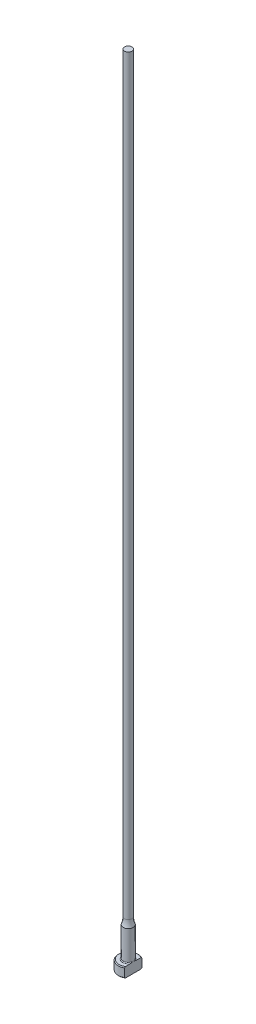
ISO-10303-21;
HEADER;
FILE_DESCRIPTION(('STEP AP214'),'2;1');
FILE_NAME('part.step','',(''),(''),'','','');
FILE_SCHEMA(('AUTOMOTIVE_DESIGN { 1 0 10303 214 1 1 1 1 }'));
ENDSEC;
DATA;
#1=APPLICATION_CONTEXT('core data for automotive mechanical design processes');
#2=APPLICATION_PROTOCOL_DEFINITION('international standard','automotive_design',2000,#1);
#3=PRODUCT_CONTEXT('',#1,'mechanical');
#4=PRODUCT('Part','Part','',(#3));
#5=PRODUCT_RELATED_PRODUCT_CATEGORY('part','',(#4));
#6=PRODUCT_DEFINITION_FORMATION('','',#4);
#7=PRODUCT_DEFINITION_CONTEXT('part definition',#1,'design');
#8=PRODUCT_DEFINITION('design','',#6,#7);
#9=PRODUCT_DEFINITION_SHAPE('','',#8);
#10=(LENGTH_UNIT() NAMED_UNIT(*) SI_UNIT(.MILLI.,.METRE.));
#11=(NAMED_UNIT(*) PLANE_ANGLE_UNIT() SI_UNIT($,.RADIAN.));
#12=(NAMED_UNIT(*) SI_UNIT($,.STERADIAN.) SOLID_ANGLE_UNIT());
#13=UNCERTAINTY_MEASURE_WITH_UNIT(LENGTH_MEASURE(1.E-05),#10,'distance_accuracy_value','');
#14=(GEOMETRIC_REPRESENTATION_CONTEXT(3) GLOBAL_UNCERTAINTY_ASSIGNED_CONTEXT((#13)) GLOBAL_UNIT_ASSIGNED_CONTEXT((#10,
#11,#12)) REPRESENTATION_CONTEXT('',''));
#15=CARTESIAN_POINT('',(0.,0.,0.));
#16=DIRECTION('',(0.,0.,1.));
#17=DIRECTION('',(1.,0.,0.));
#18=AXIS2_PLACEMENT_3D('',#15,#16,#17);
#19=CARTESIAN_POINT('',(-3.17499999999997,3.175,0.));
#20=DIRECTION('',(0.,1.,0.));
#21=DIRECTION('',(0.,0.,1.));
#22=AXIS2_PLACEMENT_3D('',#19,#20,#21);
#23=PLANE('',#22);
#24=CARTESIAN_POINT('',(0.,3.175,0.));
#25=DIRECTION('',(0.,1.,0.));
#26=DIRECTION('',(0.,0.,1.));
#27=AXIS2_PLACEMENT_3D('',#24,#25,#26);
#28=CIRCLE('',#27,2.92099999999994);
#29=CARTESIAN_POINT('',(1.58749999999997,3.175,-2.45195529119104));
#30=VERTEX_POINT('',#29);
#31=CARTESIAN_POINT('',(1.58749999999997,3.175,2.45195529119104));
#32=VERTEX_POINT('',#31);
#33=EDGE_CURVE('E105',#30,#32,#28,.T.);
#34=ORIENTED_EDGE('',*,*,#33,.T.);
#35=DIRECTION('',(0.,0.,1.));
#36=VECTOR('',#35,1.);
#37=CARTESIAN_POINT('',(1.58749999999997,3.17499999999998,2.74963065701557));
#38=LINE('',#37,#36);
#39=CARTESIAN_POINT('',(1.58749999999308,3.175,0.933255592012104));
#40=VERTEX_POINT('',#39);
#41=EDGE_CURVE('E126',#40,#32,#38,.T.);
#42=ORIENTED_EDGE('',*,*,#41,.F.);
#43=CARTESIAN_POINT('',(0.,3.175,0.));
#44=DIRECTION('',(0.,1.,0.));
#45=DIRECTION('',(0.,0.,1.));
#46=AXIS2_PLACEMENT_3D('',#43,#44,#45);
#47=CIRCLE('',#46,1.84149999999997);
#48=CARTESIAN_POINT('',(1.58749999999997,3.17500000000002,-0.933255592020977));
#49=VERTEX_POINT('',#48);
#50=EDGE_CURVE('E11',#40,#49,#47,.F.);
#51=ORIENTED_EDGE('',*,*,#50,.T.);
#52=EDGE_CURVE('E52',#30,#49,#38,.T.);
#53=ORIENTED_EDGE('',*,*,#52,.F.);
#54=EDGE_LOOP('',(#34,#42,#51,#53));
#55=FACE_BOUND('',#54,.T.);
#56=ADVANCED_FACE('F32',(#55),#23,.T.);
#57=CARTESIAN_POINT('',(0.,259.958771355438,0.));
#58=DIRECTION('',(0.,1.,0.));
#59=DIRECTION('',(0.,0.,1.));
#60=AXIS2_PLACEMENT_3D('',#57,#58,#59);
#61=CYLINDRICAL_SURFACE('',#60,3.17499999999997);
#62=CARTESIAN_POINT('',(0.,2.92100000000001,0.));
#63=DIRECTION('',(0.,1.,0.));
#64=DIRECTION('',(0.,0.,1.));
#65=AXIS2_PLACEMENT_3D('',#62,#63,#64);
#66=CIRCLE('',#65,3.17499999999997);
#67=CARTESIAN_POINT('',(1.58749999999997,2.92100000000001,2.74963065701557));
#68=VERTEX_POINT('',#67);
#69=CARTESIAN_POINT('',(1.58749999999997,2.92100000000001,-2.74963065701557));
#70=VERTEX_POINT('',#69);
#71=EDGE_CURVE('E98',#68,#70,#66,.F.);
#72=ORIENTED_EDGE('',*,*,#71,.T.);
#73=DIRECTION('',(0.,-1.,0.));
#74=VECTOR('',#73,1.);
#75=CARTESIAN_POINT('',(1.58749999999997,254.001,-2.74963065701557));
#76=LINE('',#75,#74);
#77=CARTESIAN_POINT('',(1.58749999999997,0.253999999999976,-2.74963065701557));
#78=VERTEX_POINT('',#77);
#79=EDGE_CURVE('E141',#70,#78,#76,.T.);
#80=ORIENTED_EDGE('',*,*,#79,.T.);
#81=CARTESIAN_POINT('',(0.,0.253999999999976,0.));
#82=DIRECTION('',(0.,-1.,0.));
#83=DIRECTION('',(0.,0.,-1.));
#84=AXIS2_PLACEMENT_3D('',#81,#82,#83);
#85=CIRCLE('',#84,3.17499999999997);
#86=CARTESIAN_POINT('',(1.58749999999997,0.253999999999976,2.74963065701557));
#87=VERTEX_POINT('',#86);
#88=EDGE_CURVE('E95',#78,#87,#85,.F.);
#89=ORIENTED_EDGE('',*,*,#88,.T.);
#90=DIRECTION('',(0.,-1.,0.));
#91=VECTOR('',#90,1.);
#92=CARTESIAN_POINT('',(1.58749999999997,254.001,2.74963065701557));
#93=LINE('',#92,#91);
#94=EDGE_CURVE('E88',#68,#87,#93,.T.);
#95=ORIENTED_EDGE('',*,*,#94,.F.);
#96=EDGE_LOOP('',(#72,#80,#89,#95));
#97=FACE_BOUND('',#96,.T.);
#98=ADVANCED_FACE('F191',(#97),#61,.T.);
#99=CARTESIAN_POINT('',(0.,0.,0.));
#100=DIRECTION('',(0.,-1.,0.));
#101=DIRECTION('',(0.,0.,-1.));
#102=AXIS2_PLACEMENT_3D('',#99,#100,#101);
#103=PLANE('',#102);
#104=CARTESIAN_POINT('',(0.,0.,0.));
#105=DIRECTION('',(0.,-1.,0.));
#106=DIRECTION('',(0.,0.,-1.));
#107=AXIS2_PLACEMENT_3D('',#104,#105,#106);
#108=CIRCLE('',#107,2.92100000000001);
#109=CARTESIAN_POINT('',(1.58749999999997,0.,2.45195529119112));
#110=VERTEX_POINT('',#109);
#111=CARTESIAN_POINT('',(1.58749999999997,0.,-2.45195529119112));
#112=VERTEX_POINT('',#111);
#113=EDGE_CURVE('E93',#110,#112,#108,.T.);
#114=ORIENTED_EDGE('',*,*,#113,.T.);
#115=DIRECTION('',(0.,0.,1.));
#116=VECTOR('',#115,1.);
#117=CARTESIAN_POINT('',(1.58749999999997,0.,2.74963065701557));
#118=LINE('',#117,#116);
#119=EDGE_CURVE('E78',#112,#110,#118,.T.);
#120=ORIENTED_EDGE('',*,*,#119,.T.);
#121=EDGE_LOOP('',(#114,#120));
#122=FACE_BOUND('',#121,.T.);
#123=ADVANCED_FACE('F97',(#122),#103,.T.);
#124=CARTESIAN_POINT('',(0.,3.17499999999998,0.));
#125=DIRECTION('',(0.,-1.,0.));
#126=DIRECTION('',(0.,0.,-1.));
#127=AXIS2_PLACEMENT_3D('',#124,#125,#126);
#128=CONICAL_SURFACE('',#127,2.92099999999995,0.785398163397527);
#129=ORIENTED_EDGE('',*,*,#71,.F.);
#130=CARTESIAN_POINT('',(1.58749999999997,-0.16162066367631,-6.0529050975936));
#131=CARTESIAN_POINT('',(1.58749999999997,-0.0288893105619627,-5.91567682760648));
#132=CARTESIAN_POINT('',(1.58749999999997,0.103699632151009,-5.7783103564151));
#133=CARTESIAN_POINT('',(1.58749999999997,0.368508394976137,-5.50321874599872));
#134=CARTESIAN_POINT('',(1.58749999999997,0.500728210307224,-5.36549360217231));
#135=CARTESIAN_POINT('',(1.58749999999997,0.764778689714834,-5.08953516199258));
#136=CARTESIAN_POINT('',(1.58749999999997,0.896609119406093,-4.9513016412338));
#137=CARTESIAN_POINT('',(1.58749999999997,1.15968706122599,-4.67428233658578));
#138=CARTESIAN_POINT('',(1.58749999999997,1.29093457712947,-4.53549655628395));
#139=CARTESIAN_POINT('',(1.58749999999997,1.55007705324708,-4.25997724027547));
#140=CARTESIAN_POINT('',(1.58749999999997,1.67798684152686,-4.12325766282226));
#141=CARTESIAN_POINT('',(1.58749999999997,1.9328486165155,-3.84892898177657));
#142=CARTESIAN_POINT('',(1.58749999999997,2.05980060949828,-3.71131988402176));
#143=CARTESIAN_POINT('',(1.58749999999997,2.31237508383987,-3.43493978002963));
#144=CARTESIAN_POINT('',(1.58749999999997,2.43799784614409,-3.29616903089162));
#145=CARTESIAN_POINT('',(1.58749999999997,2.68741369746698,-3.01699558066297));
#146=CARTESIAN_POINT('',(1.58749999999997,2.81120686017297,-2.8765929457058));
#147=CARTESIAN_POINT('',(1.58749999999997,3.00875865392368,-2.64816703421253));
#148=CARTESIAN_POINT('',(1.58749999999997,3.08336151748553,-2.56087478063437));
#149=CARTESIAN_POINT('',(1.58749999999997,3.2312387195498,-2.38515423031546));
#150=CARTESIAN_POINT('',(1.58749999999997,3.30451292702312,-2.29672582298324));
#151=CARTESIAN_POINT('',(1.58749999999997,3.45004422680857,-2.1174740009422));
#152=CARTESIAN_POINT('',(1.58749999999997,3.5222823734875,-2.02663514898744));
#153=CARTESIAN_POINT('',(1.58749999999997,3.66423097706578,-1.8430252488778));
#154=CARTESIAN_POINT('',(1.58749999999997,3.73394203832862,-1.75025467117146));
#155=CARTESIAN_POINT('',(1.58749999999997,3.87080633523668,-1.5606747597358));
#156=CARTESIAN_POINT('',(1.58749999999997,3.93790459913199,-1.46382547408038));
#157=CARTESIAN_POINT('',(1.58749999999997,4.06669147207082,-1.26632594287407));
#158=CARTESIAN_POINT('',(1.58749999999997,4.1283726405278,-1.16567073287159));
#159=CARTESIAN_POINT('',(1.58749999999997,4.21402252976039,-1.01165766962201));
#160=CARTESIAN_POINT('',(1.58749999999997,4.24127929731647,-0.960142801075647));
#161=CARTESIAN_POINT('',(1.58749999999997,4.2930979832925,-0.855780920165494));
#162=CARTESIAN_POINT('',(1.58749999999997,4.31765941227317,-0.802933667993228));
#163=CARTESIAN_POINT('',(1.58749999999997,4.38614656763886,-0.642461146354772));
#164=CARTESIAN_POINT('',(1.58749999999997,4.42510149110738,-0.532518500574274));
#165=CARTESIAN_POINT('',(1.58749999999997,4.46726244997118,-0.367680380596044));
#166=CARTESIAN_POINT('',(1.58749999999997,4.47844427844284,-0.314802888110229));
#167=CARTESIAN_POINT('',(1.58749999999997,4.49576654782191,-0.208209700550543));
#168=CARTESIAN_POINT('',(1.58749999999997,4.50190743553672,-0.154494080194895));
#169=CARTESIAN_POINT('',(1.58749999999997,4.50871296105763,-0.0468792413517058));
#170=CARTESIAN_POINT('',(1.58749999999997,4.5093945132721,0.00701889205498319));
#171=CARTESIAN_POINT('',(1.58749999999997,4.50527679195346,0.114606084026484));
#172=CARTESIAN_POINT('',(1.58749999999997,4.50047706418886,0.168295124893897));
#173=CARTESIAN_POINT('',(1.58749999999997,4.48579689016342,0.27448544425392));
#174=CARTESIAN_POINT('',(1.58749999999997,4.47596081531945,0.32699298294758));
#175=CARTESIAN_POINT('',(1.58749999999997,4.45181809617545,0.430974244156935));
#176=CARTESIAN_POINT('',(1.58749999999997,4.4375096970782,0.482447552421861));
#177=CARTESIAN_POINT('',(1.58749999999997,4.40502489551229,0.584460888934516));
#178=CARTESIAN_POINT('',(1.58749999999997,4.386827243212,0.634994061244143));
#179=CARTESIAN_POINT('',(1.58749999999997,4.34729308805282,0.734789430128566));
#180=CARTESIAN_POINT('',(1.58749999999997,4.3259572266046,0.784051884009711));
#181=CARTESIAN_POINT('',(1.58749999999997,4.25791922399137,0.930549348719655));
#182=CARTESIAN_POINT('',(1.58749999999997,4.20736047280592,1.0259880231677));
#183=CARTESIAN_POINT('',(1.58749999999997,4.0995545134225,1.21304313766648));
#184=CARTESIAN_POINT('',(1.58749999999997,4.04229912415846,1.30465471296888));
#185=CARTESIAN_POINT('',(1.58749999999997,3.92308746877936,1.48526211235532));
#186=CARTESIAN_POINT('',(1.58749999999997,3.86111349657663,1.57424615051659));
#187=CARTESIAN_POINT('',(1.58749999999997,3.73408621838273,1.74990003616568));
#188=CARTESIAN_POINT('',(1.58749999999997,3.66903444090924,1.83657099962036));
#189=CARTESIAN_POINT('',(1.58749999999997,3.53583371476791,2.00931764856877));
#190=CARTESIAN_POINT('',(1.58749999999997,3.46765527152,2.09537048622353));
#191=CARTESIAN_POINT('',(1.58749999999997,3.32960643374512,2.26611736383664));
#192=CARTESIAN_POINT('',(1.58749999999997,3.25973586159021,2.35081125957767));
#193=CARTESIAN_POINT('',(1.58749999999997,3.04858139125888,2.60290121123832));
#194=CARTESIAN_POINT('',(1.58749999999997,2.90542388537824,2.76872537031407));
#195=CARTESIAN_POINT('',(1.58749999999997,2.64069522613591,3.06970913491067));
#196=CARTESIAN_POINT('',(1.58749999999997,2.51959458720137,3.20528660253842));
#197=CARTESIAN_POINT('',(1.58749999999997,2.27590400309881,3.47510321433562));
#198=CARTESIAN_POINT('',(1.58749999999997,2.15331401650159,3.60934232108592));
#199=CARTESIAN_POINT('',(1.58749999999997,1.90694239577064,3.87695374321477));
#200=CARTESIAN_POINT('',(1.58749999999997,1.78315974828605,4.0103251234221));
#201=CARTESIAN_POINT('',(1.58749999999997,1.53478104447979,4.27630880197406));
#202=CARTESIAN_POINT('',(1.58749999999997,1.41018498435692,4.40892109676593));
#203=CARTESIAN_POINT('',(1.58749999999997,1.0457468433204,4.79499418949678));
#204=CARTESIAN_POINT('',(1.58749999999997,0.80507680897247,5.04767313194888));
#205=CARTESIAN_POINT('',(1.58749999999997,0.443121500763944,5.42550911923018));
#206=CARTESIAN_POINT('',(1.58749999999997,0.322378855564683,5.55118772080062));
#207=CARTESIAN_POINT('',(1.58749999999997,0.0805914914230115,5.80225207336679));
#208=CARTESIAN_POINT('',(1.58749999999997,-0.040453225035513,5.92763782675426));
#209=CARTESIAN_POINT('',(1.58749999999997,-0.161620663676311,6.0529050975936));
#210=B_SPLINE_CURVE_WITH_KNOTS('',3,(#130,#131,#132,#133,#134,#135,#136,#137,#138,#139,#140,
#141,#142,#143,#144,#145,#146,#147,#148,#149,#150,#151,#152,#153,#154,#155,#156,#157,#158,#159,
#160,#161,#162,#163,#164,#165,#166,#167,#168,#169,#170,#171,#172,#173,#174,#175,#176,#177,#178,
#179,#180,#181,#182,#183,#184,#185,#186,#187,#188,#189,#190,#191,#192,#193,#194,#195,#196,#197,
#198,#199,#200,#201,#202,#203,#204,#205,#206,#207,#208,#209),.UNSPECIFIED.,.F.,.F.,(4,2,2,2,2,2,
2,2,2,2,2,2,2,2,2,2,2,2,2,2,2,2,2,2,2,2,2,2,2,2,2,2,2,2,2,2,2,2,2,4),(0.,0.572750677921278,
1.14550874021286,1.71856057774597,2.29160869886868,2.85328006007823,3.4149477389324,
3.97649423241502,4.53801804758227,4.88249307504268,5.22700189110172,5.5751532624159,
5.92322081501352,6.27657800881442,6.63041319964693,6.80518126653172,6.9799810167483,
7.3282426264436,7.49018491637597,7.65211285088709,7.81353889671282,7.97497832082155,
8.13501929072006,8.29512313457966,8.45612518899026,8.61709438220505,8.94062993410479,
9.2645649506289,9.58978187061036,9.91483894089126,10.2441741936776,10.5735441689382,
11.2306812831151,11.7760337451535,12.3214014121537,12.8672825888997,13.4131663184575,
14.4600164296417,14.9828595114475,15.5056983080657),.UNSPECIFIED.);
#211=EDGE_CURVE('E118',#32,#68,#210,.T.);
#212=ORIENTED_EDGE('',*,*,#211,.F.);
#213=ORIENTED_EDGE('',*,*,#33,.F.);
#214=EDGE_CURVE('E117',#70,#30,#210,.T.);
#215=ORIENTED_EDGE('',*,*,#214,.F.);
#216=EDGE_LOOP('',(#129,#212,#213,#215));
#217=FACE_BOUND('',#216,.T.);
#218=ADVANCED_FACE('F162',(#217),#128,.T.);
#219=CARTESIAN_POINT('',(0.,0.253999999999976,0.));
#220=DIRECTION('',(0.,1.,0.));
#221=DIRECTION('',(0.,0.,1.));
#222=AXIS2_PLACEMENT_3D('',#219,#220,#221);
#223=CONICAL_SURFACE('',#222,3.17499999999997,0.785398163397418);
#224=ORIENTED_EDGE('',*,*,#88,.F.);
#225=CARTESIAN_POINT('',(1.58749999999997,3.33662066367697,6.0529050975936));
#226=CARTESIAN_POINT('',(1.58749999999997,3.20388931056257,5.91567682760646));
#227=CARTESIAN_POINT('',(1.58749999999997,3.07130036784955,5.77831035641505));
#228=CARTESIAN_POINT('',(1.58749999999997,2.80649160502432,5.50321874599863));
#229=CARTESIAN_POINT('',(1.58749999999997,2.67427178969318,5.3654936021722));
#230=CARTESIAN_POINT('',(1.58749999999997,2.41022131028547,5.08953516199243));
#231=CARTESIAN_POINT('',(1.58749999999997,2.27839088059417,4.95130164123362));
#232=CARTESIAN_POINT('',(1.58749999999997,2.01531293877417,4.67428233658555));
#233=CARTESIAN_POINT('',(1.58749999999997,1.88406542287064,4.5354965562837));
#234=CARTESIAN_POINT('',(1.58749999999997,1.62492294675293,4.25997724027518));
#235=CARTESIAN_POINT('',(1.58749999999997,1.49701315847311,4.12325766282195));
#236=CARTESIAN_POINT('',(1.58749999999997,1.24215138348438,3.84892898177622));
#237=CARTESIAN_POINT('',(1.58749999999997,1.11519939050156,3.71131988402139));
#238=CARTESIAN_POINT('',(1.58749999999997,0.862624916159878,3.43493978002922));
#239=CARTESIAN_POINT('',(1.58749999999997,0.737002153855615,3.29616903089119));
#240=CARTESIAN_POINT('',(1.58749999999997,0.487586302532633,3.01699558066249));
#241=CARTESIAN_POINT('',(1.58749999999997,0.363793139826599,2.8765929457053));
#242=CARTESIAN_POINT('',(1.58749999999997,0.166241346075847,2.64816703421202));
#243=CARTESIAN_POINT('',(1.58749999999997,0.0916384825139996,2.56087478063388));
#244=CARTESIAN_POINT('',(1.58749999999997,-0.0562387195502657,2.385154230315));
#245=CARTESIAN_POINT('',(1.58749999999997,-0.129512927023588,2.29672582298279));
#246=CARTESIAN_POINT('',(1.58749999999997,-0.27504422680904,2.11747400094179));
#247=CARTESIAN_POINT('',(1.58749999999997,-0.347282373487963,2.02663514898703));
#248=CARTESIAN_POINT('',(1.58749999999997,-0.489230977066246,1.84302524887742));
#249=CARTESIAN_POINT('',(1.58749999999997,-0.558942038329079,1.7502546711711));
#250=CARTESIAN_POINT('',(1.58749999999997,-0.695806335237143,1.56067475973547));
#251=CARTESIAN_POINT('',(1.58749999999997,-0.762904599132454,1.46382547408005));
#252=CARTESIAN_POINT('',(1.58749999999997,-0.891691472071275,1.26632594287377));
#253=CARTESIAN_POINT('',(1.58749999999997,-0.953372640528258,1.16567073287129));
#254=CARTESIAN_POINT('',(1.58749999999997,-1.03902252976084,1.01165766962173));
#255=CARTESIAN_POINT('',(1.58749999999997,-1.06627929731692,0.960142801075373));
#256=CARTESIAN_POINT('',(1.58749999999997,-1.11809798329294,0.85578092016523));
#257=CARTESIAN_POINT('',(1.58749999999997,-1.14265941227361,0.802933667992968));
#258=CARTESIAN_POINT('',(1.58749999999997,-1.21114656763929,0.642461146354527));
#259=CARTESIAN_POINT('',(1.58749999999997,-1.2501014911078,0.532518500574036));
#260=CARTESIAN_POINT('',(1.58749999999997,-1.29226244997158,0.367680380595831));
#261=CARTESIAN_POINT('',(1.58749999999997,-1.30344427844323,0.314802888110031));
#262=CARTESIAN_POINT('',(1.58749999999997,-1.32076654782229,0.208209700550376));
#263=CARTESIAN_POINT('',(1.58749999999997,-1.3269074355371,0.154494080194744));
#264=CARTESIAN_POINT('',(1.58749999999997,-1.333712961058,0.0468792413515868));
#265=CARTESIAN_POINT('',(1.58749999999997,-1.33439451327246,-0.00701889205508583));
#266=CARTESIAN_POINT('',(1.58749999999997,-1.33027679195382,-0.114606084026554));
#267=CARTESIAN_POINT('',(1.58749999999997,-1.32547706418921,-0.168295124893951));
#268=CARTESIAN_POINT('',(1.58749999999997,-1.31079689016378,-0.274485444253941));
#269=CARTESIAN_POINT('',(1.58749999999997,-1.3009608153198,-0.326992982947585));
#270=CARTESIAN_POINT('',(1.58749999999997,-1.27681809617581,-0.430974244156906));
#271=CARTESIAN_POINT('',(1.58749999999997,-1.26250969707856,-0.482447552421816));
#272=CARTESIAN_POINT('',(1.58749999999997,-1.23002489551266,-0.584460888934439));
#273=CARTESIAN_POINT('',(1.58749999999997,-1.21182724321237,-0.634994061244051));
#274=CARTESIAN_POINT('',(1.58749999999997,-1.1722930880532,-0.734789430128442));
#275=CARTESIAN_POINT('',(1.58749999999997,-1.15095722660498,-0.784051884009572));
#276=CARTESIAN_POINT('',(1.58749999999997,-1.08291922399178,-0.93054934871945));
#277=CARTESIAN_POINT('',(1.58749999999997,-1.03236047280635,-1.02598802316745));
#278=CARTESIAN_POINT('',(1.58749999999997,-0.924554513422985,-1.21304313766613));
#279=CARTESIAN_POINT('',(1.58749999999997,-0.86729912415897,-1.30465471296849));
#280=CARTESIAN_POINT('',(1.58749999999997,-0.748087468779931,-1.48526211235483));
#281=CARTESIAN_POINT('',(1.58749999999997,-0.686113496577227,-1.57424615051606));
#282=CARTESIAN_POINT('',(1.58749999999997,-0.55908621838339,-1.74990003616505));
#283=CARTESIAN_POINT('',(1.58749999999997,-0.494034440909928,-1.83657099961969));
#284=CARTESIAN_POINT('',(1.58749999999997,-0.360833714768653,-2.00931764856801));
#285=CARTESIAN_POINT('',(1.58749999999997,-0.292655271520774,-2.09537048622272));
#286=CARTESIAN_POINT('',(1.58749999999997,-0.154606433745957,-2.26611736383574));
#287=CARTESIAN_POINT('',(1.58749999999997,-0.0847358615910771,-2.35081125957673));
#288=CARTESIAN_POINT('',(1.58749999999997,0.126418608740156,-2.60290121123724));
#289=CARTESIAN_POINT('',(1.58749999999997,0.269576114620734,-2.76872537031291));
#290=CARTESIAN_POINT('',(1.58749999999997,0.534304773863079,-3.06970913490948));
#291=CARTESIAN_POINT('',(1.58749999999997,0.655405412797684,-3.20528660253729));
#292=CARTESIAN_POINT('',(1.58749999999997,0.899095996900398,-3.47510321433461));
#293=CARTESIAN_POINT('',(1.58749999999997,1.02168598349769,-3.60934232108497));
#294=CARTESIAN_POINT('',(1.58749999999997,1.26805760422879,-3.87695374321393));
#295=CARTESIAN_POINT('',(1.58749999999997,1.39184025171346,-4.01032512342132));
#296=CARTESIAN_POINT('',(1.58749999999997,1.64021895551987,-4.2763088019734));
#297=CARTESIAN_POINT('',(1.58749999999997,1.76481501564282,-4.40892109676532));
#298=CARTESIAN_POINT('',(1.58749999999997,2.12925315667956,-4.79499418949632));
#299=CARTESIAN_POINT('',(1.58749999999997,2.36992319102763,-5.04767313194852));
#300=CARTESIAN_POINT('',(1.58749999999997,2.73187849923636,-5.42550911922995));
#301=CARTESIAN_POINT('',(1.58749999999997,2.85262114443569,-5.55118772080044));
#302=CARTESIAN_POINT('',(1.58749999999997,3.09440850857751,-5.8022520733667));
#303=CARTESIAN_POINT('',(1.58749999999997,3.2154532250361,-5.92763782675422));
#304=CARTESIAN_POINT('',(1.58749999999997,3.33662066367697,-6.0529050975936));
#305=B_SPLINE_CURVE_WITH_KNOTS('',3,(#225,#226,#227,#228,#229,#230,#231,#232,#233,#234,#235,
#236,#237,#238,#239,#240,#241,#242,#243,#244,#245,#246,#247,#248,#249,#250,#251,#252,#253,#254,
#255,#256,#257,#258,#259,#260,#261,#262,#263,#264,#265,#266,#267,#268,#269,#270,#271,#272,#273,
#274,#275,#276,#277,#278,#279,#280,#281,#282,#283,#284,#285,#286,#287,#288,#289,#290,#291,#292,
#293,#294,#295,#296,#297,#298,#299,#300,#301,#302,#303,#304),.UNSPECIFIED.,.F.,.F.,(4,2,2,2,2,2,
2,2,2,2,2,2,2,2,2,2,2,2,2,2,2,2,2,2,2,2,2,2,2,2,2,2,2,2,2,2,2,2,2,4),(0.,0.57275067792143,
1.14550874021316,1.71856057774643,2.29160869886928,2.85328006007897,3.41494773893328,
3.97649423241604,4.53801804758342,4.88249307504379,5.2270018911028,5.57515326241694,
5.92322081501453,6.27657800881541,6.63041319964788,6.80518126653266,6.97998101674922,
7.32824262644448,7.49018491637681,7.65211285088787,7.81353889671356,7.97497832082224,
8.1350192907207,8.29512313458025,8.45612518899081,8.61709438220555,8.94062993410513,
9.26456495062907,9.58978187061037,9.91483894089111,10.2441741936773,10.5735441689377,
11.2306812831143,11.776033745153,12.3214014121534,12.8672825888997,13.4131663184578,
14.4600164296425,14.9828595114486,15.505698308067),.UNSPECIFIED.);
#306=EDGE_CURVE('E81',#112,#78,#305,.T.);
#307=ORIENTED_EDGE('',*,*,#306,.F.);
#308=ORIENTED_EDGE('',*,*,#113,.F.);
#309=EDGE_CURVE('E84',#87,#110,#305,.T.);
#310=ORIENTED_EDGE('',*,*,#309,.F.);
#311=EDGE_LOOP('',(#224,#307,#308,#310));
#312=FACE_BOUND('',#311,.T.);
#313=ADVANCED_FACE('F92',(#312),#223,.T.);
#314=CARTESIAN_POINT('',(0.,3.42900000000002,0.));
#315=DIRECTION('',(0.,1.,0.));
#316=DIRECTION('',(0.,0.,1.));
#317=AXIS2_PLACEMENT_3D('',#314,#315,#316);
#318=TOROIDAL_SURFACE('',#317,1.84149999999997,0.254);
#319=CARTESIAN_POINT('',(1.58749999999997,3.42900000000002,0.));
#320=CARTESIAN_POINT('',(1.58749999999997,3.42899942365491,-1.9220514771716E-10));
#321=CARTESIAN_POINT('',(1.58749999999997,3.42899884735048,-1.2261161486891E-07));
#322=CARTESIAN_POINT('',(1.58749999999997,3.42899773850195,-5.09676365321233E-07));
#323=CARTESIAN_POINT('',(1.58749999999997,3.42899720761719,-7.78176328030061E-07));
#324=CARTESIAN_POINT('',(1.58749999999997,3.42899614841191,-1.42307272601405E-06));
#325=CARTESIAN_POINT('',(1.58749999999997,3.42899562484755,-1.80713867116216E-06));
#326=CARTESIAN_POINT('',(1.58749999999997,3.42899463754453,-2.63494846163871E-06));
#327=CARTESIAN_POINT('',(1.58749999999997,3.42899417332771,-3.07814756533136E-06));
#328=CARTESIAN_POINT('',(1.58749999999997,3.42899261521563,-4.66897357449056E-06));
#329=CARTESIAN_POINT('',(1.58749999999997,3.42899159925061,-5.89404908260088E-06));
#330=CARTESIAN_POINT('',(1.58749999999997,3.42898979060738,-8.42427511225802E-06));
#331=CARTESIAN_POINT('',(1.58749999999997,3.42898899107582,-9.7248057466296E-06));
#332=CARTESIAN_POINT('',(1.58749999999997,3.42898598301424,-1.48060601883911E-05));
#333=CARTESIAN_POINT('',(1.58749999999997,3.42898393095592,-1.86838281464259E-05));
#334=CARTESIAN_POINT('',(1.58749999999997,3.42898057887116,-2.63261117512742E-05));
#335=CARTESIAN_POINT('',(1.58749999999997,3.42897922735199,-3.00687417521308E-05));
#336=CARTESIAN_POINT('',(1.58749999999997,3.42897347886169,-4.60276298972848E-05));
#337=CARTESIAN_POINT('',(1.58749999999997,3.42896911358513,-5.8247019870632E-05));
#338=CARTESIAN_POINT('',(1.58749999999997,3.42896211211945,-8.11070097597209E-05));
#339=CARTESIAN_POINT('',(1.58749999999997,3.42895931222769,-9.16953114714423E-05));
#340=CARTESIAN_POINT('',(1.58749999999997,3.42893712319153,-0.000168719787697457));
#341=CARTESIAN_POINT('',(1.58749999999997,3.42890881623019,-0.000232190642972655));
#342=CARTESIAN_POINT('',(1.58749999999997,3.42880276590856,-0.000479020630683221));
#343=CARTESIAN_POINT('',(1.58749999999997,3.42873165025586,-0.00066443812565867));
#344=CARTESIAN_POINT('',(1.58749999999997,3.42845137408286,-0.0013844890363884));
#345=CARTESIAN_POINT('',(1.58749999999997,3.42823526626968,-0.00191701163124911));
#346=CARTESIAN_POINT('',(1.58749999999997,3.42735449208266,-0.00409774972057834));
#347=CARTESIAN_POINT('',(1.58749999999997,3.42669768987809,-0.00574830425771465));
#348=CARTESIAN_POINT('',(1.58749999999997,3.4174405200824,-0.0289985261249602));
#349=CARTESIAN_POINT('',(1.58749999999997,3.40878325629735,-0.0505816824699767));
#350=CARTESIAN_POINT('',(1.58749999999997,3.39189297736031,-0.0929947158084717));
#351=CARTESIAN_POINT('',(1.58749999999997,3.38365605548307,-0.11382315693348));
#352=CARTESIAN_POINT('',(1.58749999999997,3.36635393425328,-0.157956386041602));
#353=CARTESIAN_POINT('',(1.58749999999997,3.35730391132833,-0.181267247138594));
#354=CARTESIAN_POINT('',(1.58749999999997,3.33936775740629,-0.228222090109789));
#355=CARTESIAN_POINT('',(1.58749999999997,3.33048420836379,-0.25186705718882));
#356=CARTESIAN_POINT('',(1.58749999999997,3.30894496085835,-0.310512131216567));
#357=CARTESIAN_POINT('',(1.58749999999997,3.29649449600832,-0.345588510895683));
#358=CARTESIAN_POINT('',(1.58749999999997,3.27296975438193,-0.415278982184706));
#359=CARTESIAN_POINT('',(1.58749999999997,3.26186987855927,-0.449884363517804));
#360=CARTESIAN_POINT('',(1.58749999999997,3.2395832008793,-0.524471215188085));
#361=CARTESIAN_POINT('',(1.58749999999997,3.22860862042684,-0.564517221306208));
#362=CARTESIAN_POINT('',(1.58749999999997,3.20902534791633,-0.645529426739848));
#363=CARTESIAN_POINT('',(1.58749999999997,3.20043582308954,-0.686500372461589));
#364=CARTESIAN_POINT('',(1.58749999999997,3.18611712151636,-0.771546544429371));
#365=CARTESIAN_POINT('',(1.58749999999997,3.18059550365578,-0.815658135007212));
#366=CARTESIAN_POINT('',(1.58749999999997,3.17455396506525,-0.904117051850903));
#367=CARTESIAN_POINT('',(1.58749999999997,3.17401361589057,-0.948462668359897));
#368=CARTESIAN_POINT('',(1.58749999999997,3.17898948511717,-1.02531896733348));
#369=CARTESIAN_POINT('',(1.58749999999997,3.1829739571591,-1.05792141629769));
#370=CARTESIAN_POINT('',(1.58749999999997,3.19569167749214,-1.12184393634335));
#371=CARTESIAN_POINT('',(1.58749999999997,3.20436049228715,-1.1531753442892));
#372=CARTESIAN_POINT('',(1.58749999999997,3.22236152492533,-1.19946468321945));
#373=CARTESIAN_POINT('',(1.58749999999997,3.2295150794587,-1.21526783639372));
#374=CARTESIAN_POINT('',(1.58749999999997,3.24587062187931,-1.24583726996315));
#375=CARTESIAN_POINT('',(1.58749999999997,3.25507530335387,-1.26060215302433));
#376=CARTESIAN_POINT('',(1.58749999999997,3.27378481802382,-1.28575815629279));
#377=CARTESIAN_POINT('',(1.58749999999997,3.28289001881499,-1.29644383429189));
#378=CARTESIAN_POINT('',(1.58749999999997,3.30268460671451,-1.31623154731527));
#379=CARTESIAN_POINT('',(1.58749999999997,3.31337067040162,-1.32533681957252));
#380=CARTESIAN_POINT('',(1.58749999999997,3.33349977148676,-1.33941140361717));
#381=CARTESIAN_POINT('',(1.58749999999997,3.34261446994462,-1.34484814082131));
#382=CARTESIAN_POINT('',(1.58749999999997,3.36161455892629,-1.35416329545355));
#383=CARTESIAN_POINT('',(1.58749999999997,3.37149946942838,-1.35804267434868));
#384=CARTESIAN_POINT('',(1.58749999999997,3.39188678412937,-1.36398436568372));
#385=CARTESIAN_POINT('',(1.58749999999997,3.40239309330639,-1.36603350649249));
#386=CARTESIAN_POINT('',(1.58749999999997,3.42360372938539,-1.3680840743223));
#387=CARTESIAN_POINT('',(1.58749999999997,3.43430795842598,-1.36808648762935));
#388=CARTESIAN_POINT('',(1.58749999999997,3.45433283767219,-1.36616208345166));
#389=CARTESIAN_POINT('',(1.58749999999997,3.46367506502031,-1.36444960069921));
#390=CARTESIAN_POINT('',(1.58749999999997,3.48195519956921,-1.35953338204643));
#391=CARTESIAN_POINT('',(1.58749999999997,3.49089304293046,-1.3563294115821));
#392=CARTESIAN_POINT('',(1.58749999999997,3.50850302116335,-1.34848006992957));
#393=CARTESIAN_POINT('',(1.58749999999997,3.5171531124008,-1.34378578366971));
#394=CARTESIAN_POINT('',(1.58749999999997,3.53371257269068,-1.33324445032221));
#395=CARTESIAN_POINT('',(1.58749999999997,3.54162163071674,-1.32739692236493));
#396=CARTESIAN_POINT('',(1.58749999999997,3.56107121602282,-1.31107304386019));
#397=CARTESIAN_POINT('',(1.58749999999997,3.57202221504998,-1.29989286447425));
#398=CARTESIAN_POINT('',(1.58749999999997,3.59202509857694,-1.27593566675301));
#399=CARTESIAN_POINT('',(1.58749999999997,3.60107086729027,-1.26315370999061));
#400=CARTESIAN_POINT('',(1.58749999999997,3.62186023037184,-1.22930733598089));
#401=CARTESIAN_POINT('',(1.58749999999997,3.63240584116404,-1.20751096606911));
#402=CARTESIAN_POINT('',(1.58749999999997,3.65004643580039,-1.16266144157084));
#403=CARTESIAN_POINT('',(1.58749999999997,3.65714435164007,-1.13960937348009));
#404=CARTESIAN_POINT('',(1.58749999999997,3.67265428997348,-1.07603916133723));
#405=CARTESIAN_POINT('',(1.58749999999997,3.67834921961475,-1.03486686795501));
#406=CARTESIAN_POINT('',(1.58749999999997,3.68382880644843,-0.951558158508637));
#407=CARTESIAN_POINT('',(1.58749999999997,3.68350976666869,-0.909417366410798));
#408=CARTESIAN_POINT('',(1.58749999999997,3.67745397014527,-0.811383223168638));
#409=CARTESIAN_POINT('',(1.58749999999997,3.66993873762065,-0.755610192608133));
#410=CARTESIAN_POINT('',(1.58749999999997,3.64933373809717,-0.644937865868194));
#411=CARTESIAN_POINT('',(1.58749999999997,3.63621897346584,-0.59004364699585));
#412=CARTESIAN_POINT('',(1.58749999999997,3.60740922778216,-0.485757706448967));
#413=CARTESIAN_POINT('',(1.58749999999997,3.59201096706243,-0.436281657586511));
#414=CARTESIAN_POINT('',(1.58749999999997,3.55922497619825,-0.338551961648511));
#415=CARTESIAN_POINT('',(1.58749999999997,3.5418584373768,-0.290291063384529));
#416=CARTESIAN_POINT('',(1.58749999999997,3.51760237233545,-0.225557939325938));
#417=CARTESIAN_POINT('',(1.58749999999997,3.51126413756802,-0.208874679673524));
#418=CARTESIAN_POINT('',(1.58749999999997,3.49830042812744,-0.17512392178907));
#419=CARTESIAN_POINT('',(1.58749999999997,3.49167176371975,-0.158057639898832));
#420=CARTESIAN_POINT('',(1.58749999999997,3.47585523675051,-0.117638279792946));
#421=CARTESIAN_POINT('',(1.58749999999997,3.46662970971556,-0.0943002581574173));
#422=CARTESIAN_POINT('',(1.58749999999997,3.44889695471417,-0.0497824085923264));
#423=CARTESIAN_POINT('',(1.58749999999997,3.44040039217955,-0.028598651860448));
#424=CARTESIAN_POINT('',(1.58749999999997,3.43130364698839,-0.00575168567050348));
#425=CARTESIAN_POINT('',(1.58749999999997,3.43064818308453,-0.00410451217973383));
#426=CARTESIAN_POINT('',(1.58749999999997,3.42976776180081,-0.00192459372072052));
#427=CARTESIAN_POINT('',(1.58749999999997,3.42955062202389,-0.00138952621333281));
#428=CARTESIAN_POINT('',(1.58749999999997,3.42926908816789,-0.000666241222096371));
#429=CARTESIAN_POINT('',(1.58749999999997,3.42919771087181,-0.000480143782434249));
#430=CARTESIAN_POINT('',(1.58749999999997,3.42909131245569,-0.000232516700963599));
#431=CARTESIAN_POINT('',(1.58749999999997,3.42906294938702,-0.000168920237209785));
#432=CARTESIAN_POINT('',(1.58749999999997,3.42904072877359,-9.17527162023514E-05));
#433=CARTESIAN_POINT('',(1.58749999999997,3.42903792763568,-8.11550293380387E-05));
#434=CARTESIAN_POINT('',(1.58749999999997,3.42903091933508,-5.82743948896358E-05));
#435=CARTESIAN_POINT('',(1.58749999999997,3.42902654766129,-4.60440001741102E-05));
#436=CARTESIAN_POINT('',(1.58749999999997,3.42902079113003,-3.00727682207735E-05));
#437=CARTESIAN_POINT('',(1.58749999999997,3.42901943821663,-2.63286807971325E-05));
#438=CARTESIAN_POINT('',(1.58749999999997,3.42901608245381,-1.86836529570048E-05));
#439=CARTESIAN_POINT('',(1.58749999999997,3.4290140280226,-1.48046517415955E-05));
#440=CARTESIAN_POINT('',(1.58749999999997,3.42901101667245,-9.72223943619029E-06));
#441=CARTESIAN_POINT('',(1.58749999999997,3.42901021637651,-8.42159649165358E-06));
#442=CARTESIAN_POINT('',(1.58749999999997,3.42900840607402,-5.89129729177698E-06));
#443=CARTESIAN_POINT('',(1.58749999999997,3.42900738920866,-4.66626867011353E-06));
#444=CARTESIAN_POINT('',(1.58749999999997,3.42900582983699,-3.07568803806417E-06));
#445=CARTESIAN_POINT('',(1.58749999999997,3.42900536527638,-2.63259565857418E-06));
#446=CARTESIAN_POINT('',(1.58749999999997,3.4290043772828,-1.80506085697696E-06));
#447=CARTESIAN_POINT('',(1.58749999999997,3.42900385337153,-1.42116387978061E-06));
#448=CARTESIAN_POINT('',(1.58749999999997,3.42900279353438,-7.76675643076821E-07));
#449=CARTESIAN_POINT('',(1.58749999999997,3.42900226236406,-5.08406487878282E-07));
#450=CARTESIAN_POINT('',(1.58749999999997,3.42900115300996,-1.21901887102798E-07));
#451=CARTESIAN_POINT('',(1.58749999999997,3.42900057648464,1.92251677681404E-10));
#452=CARTESIAN_POINT('',(1.58749999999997,3.42900000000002,0.));
#453=B_SPLINE_CURVE_WITH_KNOTS('',3,(#319,#320,#321,#322,#323,#324,#325,#326,#327,#328,#329,
#330,#331,#332,#333,#334,#335,#336,#337,#338,#339,#340,#341,#342,#343,#344,#345,#346,#347,#348,
#349,#350,#351,#352,#353,#354,#355,#356,#357,#358,#359,#360,#361,#362,#363,#364,#365,#366,#367,
#368,#369,#370,#371,#372,#373,#374,#375,#376,#377,#378,#379,#380,#381,#382,#383,#384,#385,#386,
#387,#388,#389,#390,#391,#392,#393,#394,#395,#396,#397,#398,#399,#400,#401,#402,#403,#404,#405,
#406,#407,#408,#409,#410,#411,#412,#413,#414,#415,#416,#417,#418,#419,#420,#421,#422,#423,#424,
#425,#426,#427,#428,#429,#430,#431,#432,#433,#434,#435,#436,#437,#438,#439,#440,#441,#442,#443,
#444,#445,#446,#447,#448,#449,#450,#451,#452),.UNSPECIFIED.,.T.,.F.,(4,2,2,2,2,2,2,2,2,2,2,2,2,
2,2,2,2,2,2,2,2,2,2,2,2,2,2,2,2,2,2,2,2,2,2,2,2,2,2,2,2,2,2,2,2,2,2,2,2,2,2,2,2,2,2,2,2,2,2,2,2,
2,2,2,2,2,4),(0.,1.72815458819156E-06,3.50429255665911E-06,5.44431004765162E-06,
7.3675525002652E-06,1.2119089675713E-05,1.66953775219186E-05,2.98160400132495E-05,
4.17409564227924E-05,8.0660475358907E-05,0.000113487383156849,0.000321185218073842,
0.000917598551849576,0.00264089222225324,0.00797105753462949,0.0777276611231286,
0.144923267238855,0.219939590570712,0.295714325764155,0.407362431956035,0.516367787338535,
0.640878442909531,0.766362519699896,0.899536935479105,1.03216495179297,1.13045740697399,
1.22743103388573,1.27935899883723,1.33135556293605,1.37333248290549,1.41522237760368,
1.44693946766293,1.47863694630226,1.51056074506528,1.54246916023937,1.57083210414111,
1.59919951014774,1.62861579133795,1.65804436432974,1.70472658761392,1.75155645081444,
1.82378709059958,1.89595619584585,2.01995471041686,2.1460932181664,2.31447224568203,
2.48361094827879,2.6389891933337,2.79283011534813,2.84637031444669,2.9012946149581,
2.97658236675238,3.04504771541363,3.05036697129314,3.05209849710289,3.05269709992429,
3.05290520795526,3.05293806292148,3.05297701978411,3.05298895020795,3.05300207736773,
3.05300665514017,3.0530114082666,3.05301333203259,3.05301527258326,3.05301704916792,
3.05301877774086),.UNSPECIFIED.);
#454=CARTESIAN_POINT('',(1.58749999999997,3.42900000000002,0.));
#455=VERTEX_POINT('',#454);
#456=EDGE_CURVE('E47',#455,#49,#453,.T.);
#457=ORIENTED_EDGE('',*,*,#456,.T.);
#458=ORIENTED_EDGE('',*,*,#50,.F.);
#459=CARTESIAN_POINT('',(1.58749999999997,3.42900000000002,0.));
#460=CARTESIAN_POINT('',(1.58749999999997,3.42900057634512,1.9220512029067E-10));
#461=CARTESIAN_POINT('',(1.58749999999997,3.42900115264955,1.22611614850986E-07));
#462=CARTESIAN_POINT('',(1.58749999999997,3.42900226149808,5.09676365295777E-07));
#463=CARTESIAN_POINT('',(1.58749999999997,3.42900279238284,7.78176328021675E-07));
#464=CARTESIAN_POINT('',(1.58749999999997,3.42900385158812,1.42307272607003E-06));
#465=CARTESIAN_POINT('',(1.58749999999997,3.42900437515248,1.80713867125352E-06));
#466=CARTESIAN_POINT('',(1.58749999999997,3.4290053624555,2.63494846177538E-06));
#467=CARTESIAN_POINT('',(1.58749999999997,3.42900582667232,3.0781475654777E-06));
#468=CARTESIAN_POINT('',(1.58749999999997,3.4290073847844,4.66897357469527E-06));
#469=CARTESIAN_POINT('',(1.58749999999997,3.42900840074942,5.89404908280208E-06));
#470=CARTESIAN_POINT('',(1.58749999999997,3.42901020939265,8.42427511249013E-06));
#471=CARTESIAN_POINT('',(1.58749999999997,3.42901100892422,9.72480574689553E-06));
#472=CARTESIAN_POINT('',(1.58749999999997,3.42901401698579,1.48060601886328E-05));
#473=CARTESIAN_POINT('',(1.58749999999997,3.42901606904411,1.86838281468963E-05));
#474=CARTESIAN_POINT('',(1.58749999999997,3.42901942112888,2.63261117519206E-05));
#475=CARTESIAN_POINT('',(1.58749999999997,3.42902077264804,3.00687417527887E-05));
#476=CARTESIAN_POINT('',(1.58749999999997,3.42902652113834,4.60276298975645E-05));
#477=CARTESIAN_POINT('',(1.58749999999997,3.4290308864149,5.82470198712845E-05));
#478=CARTESIAN_POINT('',(1.58749999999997,3.42903788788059,8.11070097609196E-05));
#479=CARTESIAN_POINT('',(1.58749999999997,3.42904068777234,9.16953114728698E-05));
#480=CARTESIAN_POINT('',(1.58749999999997,3.4290628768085,0.000168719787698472));
#481=CARTESIAN_POINT('',(1.58749999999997,3.42909118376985,0.000232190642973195));
#482=CARTESIAN_POINT('',(1.58749999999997,3.42919723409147,0.000479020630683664));
#483=CARTESIAN_POINT('',(1.58749999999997,3.42926834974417,0.000664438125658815));
#484=CARTESIAN_POINT('',(1.58749999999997,3.42954862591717,0.00138448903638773));
#485=CARTESIAN_POINT('',(1.58749999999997,3.42976473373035,0.00191701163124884));
#486=CARTESIAN_POINT('',(1.58749999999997,3.43064550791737,0.00409774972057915));
#487=CARTESIAN_POINT('',(1.58749999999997,3.43130231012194,0.00574830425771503));
#488=CARTESIAN_POINT('',(1.58749999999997,3.44055947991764,0.0289985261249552));
#489=CARTESIAN_POINT('',(1.58749999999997,3.44921674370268,0.0505816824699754));
#490=CARTESIAN_POINT('',(1.58749999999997,3.46610702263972,0.0929947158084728));
#491=CARTESIAN_POINT('',(1.58749999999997,3.47434394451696,0.11382315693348));
#492=CARTESIAN_POINT('',(1.58749999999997,3.49164606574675,0.157956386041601));
#493=CARTESIAN_POINT('',(1.58749999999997,3.5006960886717,0.181267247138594));
#494=CARTESIAN_POINT('',(1.58749999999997,3.51863224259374,0.228222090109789));
#495=CARTESIAN_POINT('',(1.58749999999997,3.52751579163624,0.25186705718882));
#496=CARTESIAN_POINT('',(1.58749999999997,3.54905503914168,0.310512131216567));
#497=CARTESIAN_POINT('',(1.58749999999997,3.56150550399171,0.345588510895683));
#498=CARTESIAN_POINT('',(1.58749999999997,3.5850302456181,0.415278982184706));
#499=CARTESIAN_POINT('',(1.58749999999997,3.59613012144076,0.449884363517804));
#500=CARTESIAN_POINT('',(1.58749999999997,3.61841679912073,0.524471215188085));
#501=CARTESIAN_POINT('',(1.58749999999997,3.62939137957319,0.564517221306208));
#502=CARTESIAN_POINT('',(1.58749999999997,3.6489746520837,0.645529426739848));
#503=CARTESIAN_POINT('',(1.58749999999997,3.65756417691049,0.686500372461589));
#504=CARTESIAN_POINT('',(1.58749999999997,3.67188287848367,0.771546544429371));
#505=CARTESIAN_POINT('',(1.58749999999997,3.67740449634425,0.815658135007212));
#506=CARTESIAN_POINT('',(1.58749999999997,3.68344603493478,0.904117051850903));
#507=CARTESIAN_POINT('',(1.58749999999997,3.68398638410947,0.948462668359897));
#508=CARTESIAN_POINT('',(1.58749999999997,3.67901051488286,1.02531896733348));
#509=CARTESIAN_POINT('',(1.58749999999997,3.67502604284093,1.05792141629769));
#510=CARTESIAN_POINT('',(1.58749999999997,3.66230832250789,1.12184393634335));
#511=CARTESIAN_POINT('',(1.58749999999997,3.65363950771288,1.1531753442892));
#512=CARTESIAN_POINT('',(1.58749999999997,3.6356384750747,1.19946468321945));
#513=CARTESIAN_POINT('',(1.58749999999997,3.62848492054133,1.21526783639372));
#514=CARTESIAN_POINT('',(1.58749999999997,3.61212937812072,1.24583726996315));
#515=CARTESIAN_POINT('',(1.58749999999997,3.60292469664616,1.26060215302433));
#516=CARTESIAN_POINT('',(1.58749999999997,3.58421518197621,1.28575815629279));
#517=CARTESIAN_POINT('',(1.58749999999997,3.57510998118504,1.29644383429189));
#518=CARTESIAN_POINT('',(1.58749999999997,3.55531539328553,1.31623154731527));
#519=CARTESIAN_POINT('',(1.58749999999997,3.54462932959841,1.32533681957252));
#520=CARTESIAN_POINT('',(1.58749999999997,3.52450022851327,1.33941140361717));
#521=CARTESIAN_POINT('',(1.58749999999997,3.51538553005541,1.34484814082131));
#522=CARTESIAN_POINT('',(1.58749999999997,3.49638544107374,1.35416329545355));
#523=CARTESIAN_POINT('',(1.58749999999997,3.48650053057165,1.35804267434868));
#524=CARTESIAN_POINT('',(1.58749999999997,3.46611321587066,1.36398436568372));
#525=CARTESIAN_POINT('',(1.58749999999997,3.45560690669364,1.36603350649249));
#526=CARTESIAN_POINT('',(1.58749999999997,3.43439627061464,1.3680840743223));
#527=CARTESIAN_POINT('',(1.58749999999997,3.42369204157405,1.36808648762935));
#528=CARTESIAN_POINT('',(1.58749999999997,3.40366716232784,1.36616208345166));
#529=CARTESIAN_POINT('',(1.58749999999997,3.39432493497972,1.36444960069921));
#530=CARTESIAN_POINT('',(1.58749999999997,3.37604480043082,1.35953338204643));
#531=CARTESIAN_POINT('',(1.58749999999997,3.36710695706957,1.3563294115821));
#532=CARTESIAN_POINT('',(1.58749999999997,3.34949697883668,1.34848006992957));
#533=CARTESIAN_POINT('',(1.58749999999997,3.34084688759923,1.34378578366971));
#534=CARTESIAN_POINT('',(1.58749999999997,3.32428742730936,1.33324445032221));
#535=CARTESIAN_POINT('',(1.58749999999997,3.31637836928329,1.32739692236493));
#536=CARTESIAN_POINT('',(1.58749999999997,3.29692878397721,1.31107304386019));
#537=CARTESIAN_POINT('',(1.58749999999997,3.28597778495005,1.29989286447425));
#538=CARTESIAN_POINT('',(1.58749999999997,3.26597490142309,1.27593566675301));
#539=CARTESIAN_POINT('',(1.58749999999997,3.25692913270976,1.26315370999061));
#540=CARTESIAN_POINT('',(1.58749999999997,3.23613976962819,1.22930733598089));
#541=CARTESIAN_POINT('',(1.58749999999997,3.22559415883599,1.20751096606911));
#542=CARTESIAN_POINT('',(1.58749999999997,3.20795356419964,1.16266144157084));
#543=CARTESIAN_POINT('',(1.58749999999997,3.20085564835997,1.13960937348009));
#544=CARTESIAN_POINT('',(1.58749999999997,3.18534571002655,1.07603916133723));
#545=CARTESIAN_POINT('',(1.58749999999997,3.17965078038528,1.03486686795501));
#546=CARTESIAN_POINT('',(1.58749999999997,3.1741711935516,0.951558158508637));
#547=CARTESIAN_POINT('',(1.58749999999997,3.17449023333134,0.909417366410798));
#548=CARTESIAN_POINT('',(1.58749999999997,3.18054602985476,0.811383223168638));
#549=CARTESIAN_POINT('',(1.58749999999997,3.18806126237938,0.755610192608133));
#550=CARTESIAN_POINT('',(1.58749999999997,3.20866626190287,0.644937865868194));
#551=CARTESIAN_POINT('',(1.58749999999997,3.2217810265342,0.59004364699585));
#552=CARTESIAN_POINT('',(1.58749999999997,3.25059077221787,0.485757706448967));
#553=CARTESIAN_POINT('',(1.58749999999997,3.2659890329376,0.43628165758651));
#554=CARTESIAN_POINT('',(1.58749999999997,3.29877502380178,0.338551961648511));
#555=CARTESIAN_POINT('',(1.58749999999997,3.31614156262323,0.290291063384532));
#556=CARTESIAN_POINT('',(1.58749999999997,3.34039762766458,0.225557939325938));
#557=CARTESIAN_POINT('',(1.58749999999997,3.346735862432,0.208874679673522));
#558=CARTESIAN_POINT('',(1.58749999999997,3.35969957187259,0.175123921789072));
#559=CARTESIAN_POINT('',(1.58749999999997,3.3663282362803,0.15805763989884));
#560=CARTESIAN_POINT('',(1.58749999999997,3.3821447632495,0.117638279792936));
#561=CARTESIAN_POINT('',(1.58749999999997,3.39137029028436,0.0943002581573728));
#562=CARTESIAN_POINT('',(1.58749999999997,3.40910304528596,0.0497824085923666));
#563=CARTESIAN_POINT('',(1.58749999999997,3.41759960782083,0.0285986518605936));
#564=CARTESIAN_POINT('',(1.58749999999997,3.42669635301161,0.00575168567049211));
#565=CARTESIAN_POINT('',(1.58749999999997,3.42735181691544,0.00410451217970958));
#566=CARTESIAN_POINT('',(1.58749999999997,3.42823223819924,0.00192459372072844));
#567=CARTESIAN_POINT('',(1.58749999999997,3.42844937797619,0.00138952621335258));
#568=CARTESIAN_POINT('',(1.58749999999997,3.42873091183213,0.000666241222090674));
#569=CARTESIAN_POINT('',(1.58749999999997,3.42880228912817,0.000480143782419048));
#570=CARTESIAN_POINT('',(1.58749999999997,3.42890868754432,0.000232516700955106));
#571=CARTESIAN_POINT('',(1.58749999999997,3.42893705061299,0.000168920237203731));
#572=CARTESIAN_POINT('',(1.58749999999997,3.42895927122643,9.17527161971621E-05));
#573=CARTESIAN_POINT('',(1.58749999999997,3.42896207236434,8.1155029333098E-05));
#574=CARTESIAN_POINT('',(1.58749999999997,3.42896908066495,5.82743948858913E-05));
#575=CARTESIAN_POINT('',(1.58749999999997,3.42897345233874,4.60440001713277E-05));
#576=CARTESIAN_POINT('',(1.58749999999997,3.42897920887,3.00727682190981E-05));
#577=CARTESIAN_POINT('',(1.58749999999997,3.42898056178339,2.63286807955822E-05));
#578=CARTESIAN_POINT('',(1.58749999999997,3.42898391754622,1.86836529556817E-05));
#579=CARTESIAN_POINT('',(1.58749999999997,3.42898597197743,1.48046517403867E-05));
#580=CARTESIAN_POINT('',(1.58749999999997,3.42898898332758,9.72223943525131E-06));
#581=CARTESIAN_POINT('',(1.58749999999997,3.42898978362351,8.42159649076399E-06));
#582=CARTESIAN_POINT('',(1.58749999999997,3.42899159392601,5.89129729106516E-06));
#583=CARTESIAN_POINT('',(1.58749999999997,3.42899261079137,4.66626866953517E-06));
#584=CARTESIAN_POINT('',(1.58749999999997,3.42899417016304,3.0756880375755E-06));
#585=CARTESIAN_POINT('',(1.58749999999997,3.42899463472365,2.63259565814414E-06));
#586=CARTESIAN_POINT('',(1.58749999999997,3.42899562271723,1.80506085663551E-06));
#587=CARTESIAN_POINT('',(1.58749999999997,3.42899614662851,1.42116387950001E-06));
#588=CARTESIAN_POINT('',(1.58749999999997,3.42899720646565,7.7667564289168E-07));
#589=CARTESIAN_POINT('',(1.58749999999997,3.42899773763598,5.0840648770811E-07));
#590=CARTESIAN_POINT('',(1.58749999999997,3.42899884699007,1.21901887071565E-07));
#591=CARTESIAN_POINT('',(1.58749999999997,3.42899942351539,-1.92251650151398E-10));
#592=CARTESIAN_POINT('',(1.58749999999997,3.42900000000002,0.));
#593=B_SPLINE_CURVE_WITH_KNOTS('',3,(#459,#460,#461,#462,#463,#464,#465,#466,#467,#468,#469,
#470,#471,#472,#473,#474,#475,#476,#477,#478,#479,#480,#481,#482,#483,#484,#485,#486,#487,#488,
#489,#490,#491,#492,#493,#494,#495,#496,#497,#498,#499,#500,#501,#502,#503,#504,#505,#506,#507,
#508,#509,#510,#511,#512,#513,#514,#515,#516,#517,#518,#519,#520,#521,#522,#523,#524,#525,#526,
#527,#528,#529,#530,#531,#532,#533,#534,#535,#536,#537,#538,#539,#540,#541,#542,#543,#544,#545,
#546,#547,#548,#549,#550,#551,#552,#553,#554,#555,#556,#557,#558,#559,#560,#561,#562,#563,#564,
#565,#566,#567,#568,#569,#570,#571,#572,#573,#574,#575,#576,#577,#578,#579,#580,#581,#582,#583,
#584,#585,#586,#587,#588,#589,#590,#591,#592),.UNSPECIFIED.,.T.,.F.,(4,2,2,2,2,2,2,2,2,2,2,2,2,
2,2,2,2,2,2,2,2,2,2,2,2,2,2,2,2,2,2,2,2,2,2,2,2,2,2,2,2,2,2,2,2,2,2,2,2,2,2,2,2,2,2,2,2,2,2,2,2,
2,2,2,2,2,4),(0.,1.72815458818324E-06,3.50429255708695E-06,5.44431004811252E-06,
7.36755250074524E-06,1.21190896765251E-05,1.66953775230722E-05,2.98160400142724E-05,
4.17409564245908E-05,8.06604753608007E-05,0.000113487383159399,0.000321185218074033,
0.000917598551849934,0.00264089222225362,0.00797105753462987,0.077727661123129,
0.144923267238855,0.219939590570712,0.295714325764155,0.407362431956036,0.516367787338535,
0.640878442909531,0.766362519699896,0.899536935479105,1.03216495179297,1.13045740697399,
1.22743103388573,1.27935899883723,1.33135556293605,1.37333248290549,1.41522237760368,
1.44693946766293,1.47863694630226,1.51056074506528,1.54246916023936,1.57083210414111,
1.59919951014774,1.62861579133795,1.65804436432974,1.70472658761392,1.75155645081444,
1.82378709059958,1.89595619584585,2.01995471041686,2.1460932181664,2.31447224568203,
2.48361094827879,2.6389891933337,2.79283011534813,2.84637031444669,2.9012946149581,
2.97658236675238,3.04504771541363,3.05036697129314,3.05209849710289,3.05269709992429,
3.05290520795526,3.05293806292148,3.05297701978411,3.05298895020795,3.05300207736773,
3.05300665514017,3.0530114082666,3.05301333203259,3.05301527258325,3.05301704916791,
3.05301877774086),.UNSPECIFIED.);
#594=EDGE_CURVE('E147',#40,#455,#593,.T.);
#595=ORIENTED_EDGE('',*,*,#594,.T.);
#596=CARTESIAN_POINT('',(0.,3.42900000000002,0.));
#597=DIRECTION('',(0.,1.,0.));
#598=DIRECTION('',(0.,0.,1.));
#599=AXIS2_PLACEMENT_3D('',#596,#597,#598);
#600=CIRCLE('',#599,1.58749999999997);
#601=EDGE_CURVE('E40',#455,#455,#600,.T.);
#602=ORIENTED_EDGE('',*,*,#601,.F.);
#603=EDGE_LOOP('',(#457,#458,#595,#602));
#604=FACE_BOUND('',#603,.T.);
#605=ADVANCED_FACE('F34',(#604),#318,.F.);
#606=CARTESIAN_POINT('',(-1.18998999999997,254.,0.));
#607=DIRECTION('',(0.,1.,0.));
#608=DIRECTION('',(0.,0.,1.));
#609=AXIS2_PLACEMENT_3D('',#606,#607,#608);
#610=PLANE('',#609);
#611=CARTESIAN_POINT('',(0.,254.,0.));
#612=DIRECTION('',(0.,1.,0.));
#613=DIRECTION('',(0.,0.,1.));
#614=AXIS2_PLACEMENT_3D('',#611,#612,#613);
#615=CIRCLE('',#614,1.18998999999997);
#616=CARTESIAN_POINT('',(0.,254.,1.18998999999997));
#617=VERTEX_POINT('',#616);
#618=EDGE_CURVE('E108',#617,#617,#615,.T.);
#619=ORIENTED_EDGE('',*,*,#618,.T.);
#620=EDGE_LOOP('',(#619));
#621=FACE_BOUND('',#620,.T.);
#622=ADVANCED_FACE('F180',(#621),#610,.T.);
#623=CARTESIAN_POINT('',(0.,259.958771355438,0.));
#624=DIRECTION('',(0.,1.,0.));
#625=DIRECTION('',(0.,0.,1.));
#626=AXIS2_PLACEMENT_3D('',#623,#624,#625);
#627=CYLINDRICAL_SURFACE('',#626,1.18998999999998);
#628=CARTESIAN_POINT('',(0.,14.9114164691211,0.));
#629=DIRECTION('',(0.,1.,0.));
#630=DIRECTION('',(0.,0.,1.));
#631=AXIS2_PLACEMENT_3D('',#628,#629,#630);
#632=CIRCLE('',#631,1.18998999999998);
#633=CARTESIAN_POINT('',(0.,14.9114164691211,1.18998999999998));
#634=VERTEX_POINT('',#633);
#635=EDGE_CURVE('E111',#634,#634,#632,.T.);
#636=ORIENTED_EDGE('',*,*,#635,.T.);
#637=EDGE_LOOP('',(#636));
#638=FACE_BOUND('',#637,.T.);
#639=ORIENTED_EDGE('',*,*,#618,.F.);
#640=EDGE_LOOP('',(#639));
#641=FACE_BOUND('',#640,.T.);
#642=ADVANCED_FACE('F174',(#638,#641),#627,.T.);
#643=CARTESIAN_POINT('',(0.,14.9114164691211,0.));
#644=DIRECTION('',(0.,1.,0.));
#645=DIRECTION('',(0.,0.,1.));
#646=AXIS2_PLACEMENT_3D('',#643,#644,#645);
#647=TOROIDAL_SURFACE('',#646,7.53998999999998,6.35);
#648=CARTESIAN_POINT('',(0.,12.7,0.));
#649=DIRECTION('',(0.,1.,0.));
#650=DIRECTION('',(0.,0.,1.));
#651=AXIS2_PLACEMENT_3D('',#648,#649,#650);
#652=CIRCLE('',#651,1.58749999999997);
#653=CARTESIAN_POINT('',(0.,12.7,1.58749999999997));
#654=VERTEX_POINT('',#653);
#655=EDGE_CURVE('E114',#654,#654,#652,.T.);
#656=ORIENTED_EDGE('',*,*,#655,.T.);
#657=EDGE_LOOP('',(#656));
#658=FACE_BOUND('',#657,.T.);
#659=ORIENTED_EDGE('',*,*,#635,.F.);
#660=EDGE_LOOP('',(#659));
#661=FACE_BOUND('',#660,.T.);
#662=ADVANCED_FACE('F168',(#658,#661),#647,.F.);
#663=CARTESIAN_POINT('',(0.,259.958771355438,0.));
#664=DIRECTION('',(0.,1.,0.));
#665=DIRECTION('',(0.,0.,1.));
#666=AXIS2_PLACEMENT_3D('',#663,#664,#665);
#667=CYLINDRICAL_SURFACE('',#666,1.58749999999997);
#668=ORIENTED_EDGE('',*,*,#601,.T.);
#669=EDGE_LOOP('',(#668));
#670=FACE_BOUND('',#669,.T.);
#671=ORIENTED_EDGE('',*,*,#655,.F.);
#672=EDGE_LOOP('',(#671));
#673=FACE_BOUND('',#672,.T.);
#674=ADVANCED_FACE('F165',(#670,#673),#667,.T.);
#675=CARTESIAN_POINT('',(1.58749999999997,254.001,2.74963065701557));
#676=DIRECTION('',(1.,0.,0.));
#677=DIRECTION('',(0.,0.,-1.));
#678=AXIS2_PLACEMENT_3D('',#675,#676,#677);
#679=PLANE('',#678);
#680=ORIENTED_EDGE('',*,*,#309,.T.);
#681=ORIENTED_EDGE('',*,*,#119,.F.);
#682=ORIENTED_EDGE('',*,*,#306,.T.);
#683=ORIENTED_EDGE('',*,*,#79,.F.);
#684=ORIENTED_EDGE('',*,*,#214,.T.);
#685=ORIENTED_EDGE('',*,*,#52,.T.);
#686=ORIENTED_EDGE('',*,*,#456,.F.);
#687=ORIENTED_EDGE('',*,*,#594,.F.);
#688=ORIENTED_EDGE('',*,*,#41,.T.);
#689=ORIENTED_EDGE('',*,*,#211,.T.);
#690=ORIENTED_EDGE('',*,*,#94,.T.);
#691=EDGE_LOOP('',(#680,#681,#682,#683,#684,#685,#686,#687,#688,#689,#690));
#692=FACE_BOUND('',#691,.T.);
#693=ADVANCED_FACE('F80',(#692),#679,.T.);
#694=CLOSED_SHELL('',(#56,#98,#123,#218,#313,#605,#622,#642,#662,#674,#693));
#695=MANIFOLD_SOLID_BREP('B2',#694);
#696=ADVANCED_BREP_SHAPE_REPRESENTATION('',(#18,#695),#14);
#697=SHAPE_DEFINITION_REPRESENTATION(#9,#696);
ENDSEC;
END-ISO-10303-21;
